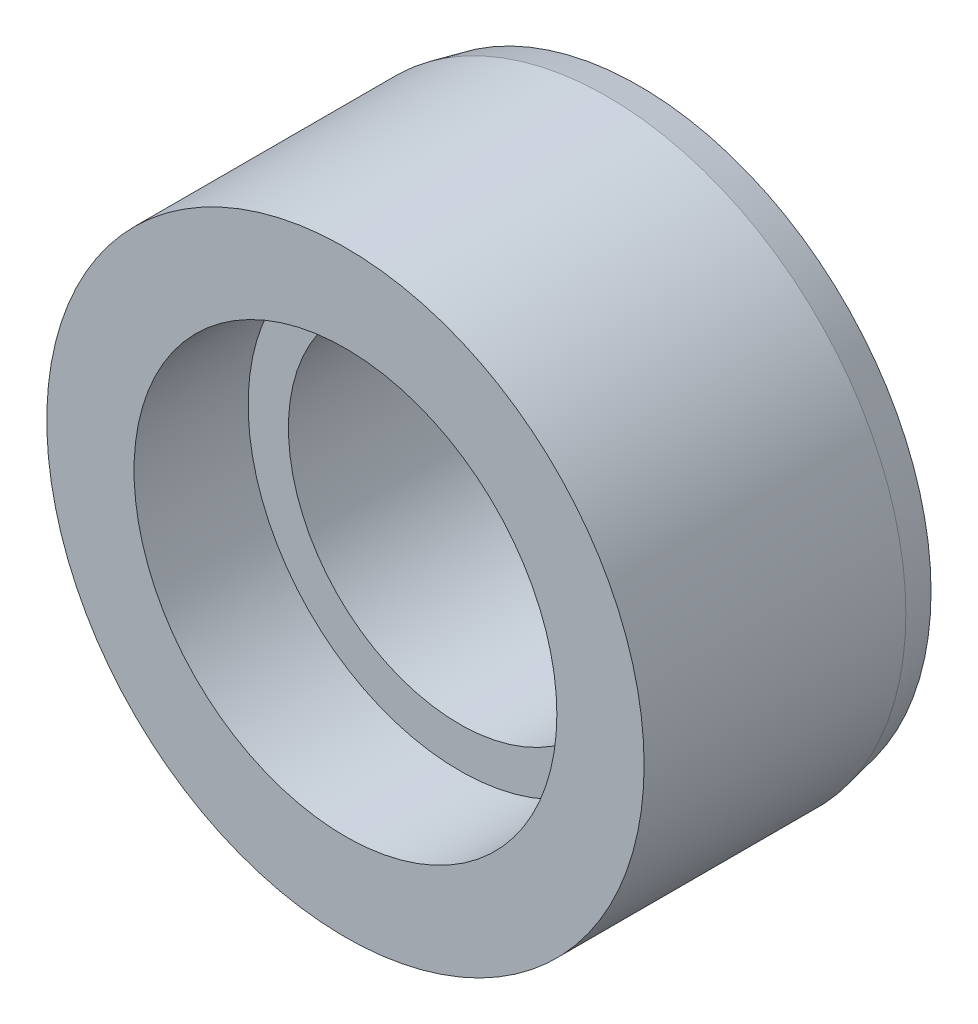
from build123d import *


with BuildPart() as part:
    # Sketch1 → Revolve1 (revolve)
    with BuildSketch(Plane(origin=(0, 0, 0), x_dir=(0, 0, -1), z_dir=(1, 0, 0)), mode=Mode.PRIVATE) as revolve1_sk:
        Polygon((0, 11.303), (9.906, 11.303), (11.1125, 11.049), (11.1125, 6.477), (4.318, 6.477), (4.318, 8.001), (0, 8.001), align=None)
    revolve(revolve1_sk.sketch.rotate(Axis((0, 0, 0), (0, 0, -1)), 90), axis=Axis((0, 0, 0), (0, 0, -1)))


solid = part.part
